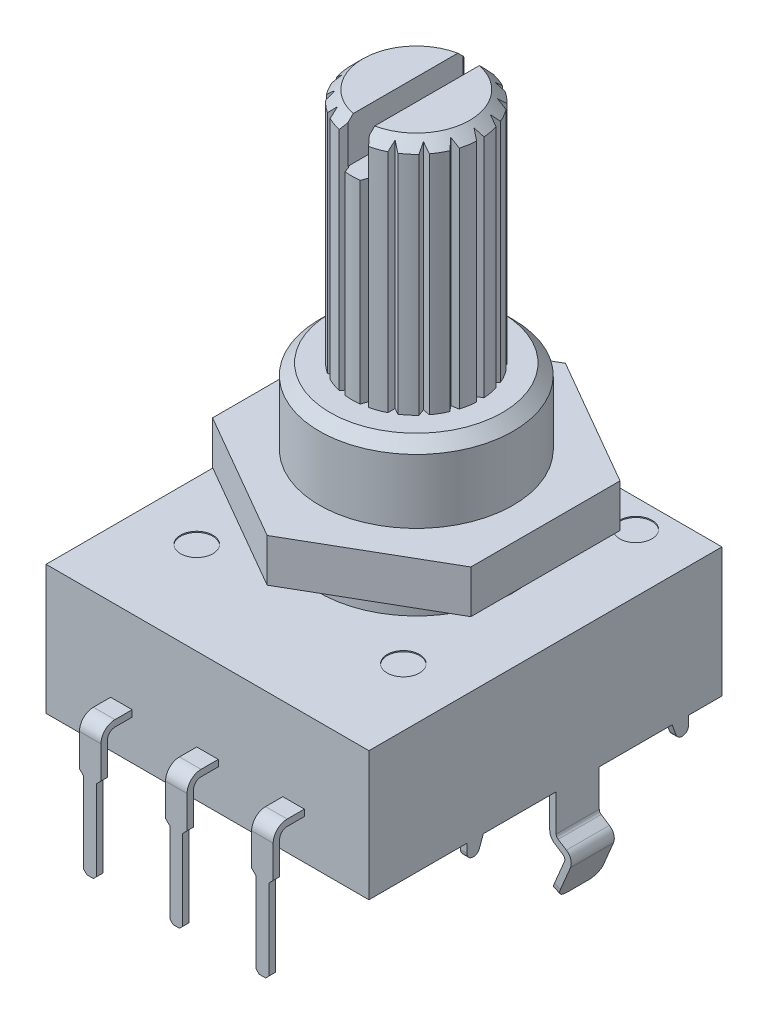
from build123d import *

# Parameters (mm, degrees)
SKETCH1_W                               = 15
SKETCH1_H                               = 16.4
BODY_DEPTH                              = 6
PCB_SPACERS_DEPTH                       = 0.3
RIGHT_PCB_TANG_DEPTH                    = 1
FILLET1_R                               = 0.5
FILLET1_OF_LEFT_PCB_TANG_R              = 0.5
SKETCH4_R                               = 0.75
DIMPLES_DEPTH                           = 0.05
CONTACTS_DEPTH                          = 4.5
CUT_EXTRUDE2_START                      = -1.45
CUT_EXTRUDE2_DEPTH                      = 1.45
CHAMFER1_SIZE                           = 0.15
SCREWDRIVER_SLOT_REACH                  = 24.706
SCREWDRIVER_SLOT_END_RADIUS             = 2.98
SKETCH8_W                               = 1
SKETCH8_H                               = 2
SCREWDRIVER_SLOT_DIRECTION_2_REACH      = 24.706
SCREWDRIVER_SLOT_DIRECTION_2_END_RADIUS = 2.98
SERATION_REACH                          = 24.155
F_18_CERATIONS_COUNT                    = 18
SKETCH10_R                              = 4
NUT_DEPTH                               = 2


with BuildPart() as part:
    # Sketch1 → body (new body)
    with BuildSketch(Plane(origin=(0, 0, 0), x_dir=(1, 0, 0), z_dir=(0, 1, 0))):
        with Locations((0, -1.5)):
            Rectangle(SKETCH1_W, SKETCH1_H)
    extrude(amount=-BODY_DEPTH)

    # Sketch2 → pcb spacers (add)
    with BuildSketch(Plane(origin=(7.5, 0, 0), x_dir=(0, 0, -1), z_dir=(1, 0, 0))):
        with BuildLine():
            Line((-5.15, -6), (-5.15, -6.4))
            ThreePointArc((-5.15, -6.4), (-4.902094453, -6.695442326), (-4.568092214, -6.502606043))
            Line((-4.568092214, -6.502606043), (-4.385158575, -6))
            Line((-4.385158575, -6), (-5.15, -6))
        make_face()
        with BuildLine():
            Line((5.15, -6), (5.15, -6.4))
            ThreePointArc((5.15, -6.4), (4.902094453, -6.695442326), (4.568092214, -6.502606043))
            Line((4.568092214, -6.502606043), (4.385158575, -6))
            Line((4.385158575, -6), (5.15, -6))
        make_face()
    pcb_spacers = extrude(amount=-PCB_SPACERS_DEPTH)

    # Sketch3 → right pcb tang (add, symmetric)
    with BuildSketch(Plane.XY):
        with BuildLine():
            Line((7.5, -6), (7.5, -7.703188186))
            ThreePointArc((7.5, -7.703188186), (7.524378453, -7.798880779), (7.591570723, -7.871244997))
            Line((7.591570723, -7.871244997), (7.971073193, -8.116097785))
            ThreePointArc((7.971073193, -8.116097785), (8.177716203, -8.388634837), (8.160830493, -8.730237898))
            Line((8.160830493, -8.730237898), (7.5, -10.3))
            Line((7.5, -10.3), (7.223501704, -10.183601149))
            Line((7.223501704, -10.183601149), (7.884332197, -8.613839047))
            ThreePointArc((7.884332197, -8.613839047), (7.891086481, -8.477197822), (7.808429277, -8.368183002))
            Line((7.808429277, -8.368183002), (7.428926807, -8.123330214))
            ThreePointArc((7.428926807, -8.123330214), (7.260946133, -7.942419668), (7.2, -7.703188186))
            Line((7.2, -7.703188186), (7.2, -6))
            Line((7.2, -6), (7.5, -6))
        make_face()
    right_pcb_tang = extrude(amount=RIGHT_PCB_TANG_DEPTH, both=True)

    # Fillet1
    fillet1_edges = [part.edges().sort_by_distance(p)[0] for p in [
        (7.361750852, -10.241800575, -1),
        (7.361750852, -10.241800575, 1),
    ]]
    fillet(fillet1_edges, radius=FILLET1_R)

    # left pcb tang: pcb spacers, right pcb tang across plane
    add(pcb_spacers.mirror(Plane(origin=(0, 0, 0), x_dir=(0, 0, 1), z_dir=(1, 0, 0))))
    add(right_pcb_tang.mirror(Plane(origin=(0, 0, 0), x_dir=(0, 0, 1), z_dir=(1, 0, 0))))

    # Fillet1 of left pcb tang
    fillet1_of_left_pcb_tang_edges = [part.edges().sort_by_distance(p)[0] for p in [
        (-7.361750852, -10.241800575, -1),
        (-7.361750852, -10.241800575, 1),
    ]]
    fillet(fillet1_of_left_pcb_tang_edges, radius=FILLET1_OF_LEFT_PCB_TANG_R)

    # Sketch4 → dimples (cut)
    with BuildSketch(Plane(origin=(0, 0, 0), x_dir=(1, 0, 0), z_dir=(0, 1, 0))):
        with Locations(Location((-4.8, 5.4, 0), (0, 0, 270))):
            Circle(SKETCH4_R)
        with Locations(Location((4.8, 5.4, 0), (0, 0, 90))):
            Circle(SKETCH4_R)
        with Locations(Location((4.8, -5.4, 0), (0, 0, 270))):
            Circle(SKETCH4_R)
        with Locations(Location((-4.8, -5.4, 0), (0, 0, 90))):
            Circle(SKETCH4_R)
    extrude(amount=-DIMPLES_DEPTH, mode=Mode.SUBTRACT)

    # Sketch5 → contacts (add, symmetric)
    with BuildSketch(Plane(origin=(0, 0, 0), x_dir=(0, 0, -1), z_dir=(1, 0, 0))):
        with BuildLine():
            Line((-9.7, -3.85), (-10.5, -3.85))
            ThreePointArc((-10.5, -3.85), (-10.959619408, -4.040380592), (-11.15, -4.5))
            Line((-11.15, -4.5), (-11.15, -10.095442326))
            Line((-11.15, -10.095442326), (-10.85, -10.095442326))
            Line((-10.85, -10.095442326), (-10.85, -4.5))
            ThreePointArc((-10.85, -4.5), (-10.747487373, -4.252512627), (-10.5, -4.15))
            Line((-10.5, -4.15), (-9.7, -4.15))
            Line((-9.7, -4.15), (-9.7, -3.85))
        make_face()
    extrude(amount=CONTACTS_DEPTH, both=True)

    # Sketch6 → Cut-Extrude2 (cut)
    with BuildSketch(Plane.XY.offset(11.15).offset(CUT_EXTRUDE2_START)):
        Polygon((-4.5, -6), (-4.3, -6.2), (-4.3, -10.095442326), (-4.5, -10.095442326), align=None)
        Polygon((4.5, -6), (4.3, -6.2), (4.3, -10.095442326), (4.5, -10.095442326), align=None)
        Polygon((-3.7, -10.095442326), (-3.7, -6.2), (-3.5, -6), (-3.5, -3.85), (-0.5, -3.85), (-0.5, -6), (-0.3, -6.2), (-0.3, -10.095442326), align=None)
        Polygon((3.7, -10.095442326), (3.7, -6.2), (3.5, -6), (3.5, -3.85), (0.5, -3.85), (0.5, -6), (0.3, -6.2), (0.3, -10.095442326), align=None)
    extrude(amount=CUT_EXTRUDE2_DEPTH, mode=Mode.SUBTRACT)

    # Chamfer1
    chamfer1_edges = [part.edges().sort_by_distance(p)[0] for p in [
        (-4.3, -10.095442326, 11),
        (4.3, -10.095442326, 11),
        (-0.3, -10.095442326, 11),
        (-3.7, -10.095442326, 11),
        (3.7, -10.095442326, 11),
        (0.3, -10.095442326, 11),
    ]]
    chamfer(chamfer1_edges, length=CHAMFER1_SIZE)

    # Sketch7 → main stem (revolve)
    with BuildSketch(Plane.XY, mode=Mode.PRIVATE) as main_stem_sk:
        Polygon((-4.5, 0), (-4.5, 6.5), (-4, 7), (-2.98, 7), (-2.98, 17.5), (-2.48, 18), (0, 18), (0, 0), align=None)
    revolve(main_stem_sk.sketch.rotate(Axis((0, 0, 0), (0, 1, 0)), 270), axis=Axis((0, 0, 0), (0, 1, 0)))

    # screwdriver slot: up to this cylinder (the profile starts inside it)
    screwdriver_slot_end = Plane(origin=(0, 17, 0), z_dir=(0, -1, 0)) * Cylinder(SCREWDRIVER_SLOT_END_RADIUS, 56.372, mode=Mode.PRIVATE)
    # Sketch8 → screwdriver slot (cut, up to the surface)
    with BuildSketch(Plane.XY, mode=Mode.PRIVATE) as screwdriver_slot_sk1:
        with Locations((0, 17)):
            Rectangle(SKETCH8_W, SKETCH8_H)
    screwdriver_slot_tool1 = extrude(screwdriver_slot_sk1.sketch, amount=-SCREWDRIVER_SLOT_REACH, mode=Mode.PRIVATE) & screwdriver_slot_end
    add(screwdriver_slot_tool1.solids().sort_by_distance((0, 17, 0))[0], mode=Mode.SUBTRACT)

    # screwdriver slot direction 2: up to this cylinder (the profile starts inside it)
    screwdriver_slot_direction_2_end = Plane(origin=(0, 17, 0), z_dir=(0, -1, 0)) * Cylinder(SCREWDRIVER_SLOT_DIRECTION_2_END_RADIUS, 56.372, mode=Mode.PRIVATE)
    # Sketch8 → screwdriver slot direction 2 (cut, up to the surface)
    with BuildSketch(Plane.XY, mode=Mode.PRIVATE) as screwdriver_slot_direction_2_sk1:
        with Locations((0, 17)):
            Rectangle(SKETCH8_W, SKETCH8_H)
    screwdriver_slot_direction_2_tool1 = extrude(screwdriver_slot_direction_2_sk1.sketch, amount=SCREWDRIVER_SLOT_DIRECTION_2_REACH, mode=Mode.PRIVATE) & screwdriver_slot_direction_2_end
    add(screwdriver_slot_direction_2_tool1.solids().sort_by_distance((0, 17, 0))[0], mode=Mode.SUBTRACT)

    # seration: up to this cone (the profile starts inside it)
    seration_end = Plane(origin=(0, 7, 0), z_dir=(0, -1, 0)).offset(-13.479999) * Cone(1e-06, 51.615, 51.614999, align=(Align.CENTER, Align.CENTER, Align.MIN), mode=Mode.PRIVATE)
    # Sketch9 → seration (cut, up to the surface)
    with BuildSketch(Plane(origin=(0, 7, 0), x_dir=(1, 0, 0), z_dir=(0, 1, 0)), mode=Mode.PRIVATE) as seration_sk1:
        with BuildLine():
            Line((2.68, 0), (2.975124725, 0.17039034))
            ThreePointArc((2.975124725, 0.17039034), (2.98, 0), (2.975124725, -0.17039034))
            Line((2.975124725, -0.17039034), (2.68, 0))
        make_face()
    seration_tool1 = extrude(seration_sk1.sketch, amount=SERATION_REACH, mode=Mode.PRIVATE) & seration_end
    seration = seration_tool1.solids().sort_by_distance((2.878912, 7, 0))[0]
    add(seration, mode=Mode.SUBTRACT)

    # 18 cerations: seration ×18 about axis
    f_18_cerations_axis = Axis((0, 0, 0), (0, 1, 0))
    for i in range(1, F_18_CERATIONS_COUNT):
        add(seration.rotate(f_18_cerations_axis, i * 360 / F_18_CERATIONS_COUNT), mode=Mode.SUBTRACT)


with BuildPart() as body_2:
    # Sketch10 → nut (new body)
    with BuildSketch(Plane(origin=(0, 1.524, 0), x_dir=(-1, 0, 0), z_dir=(0, 1, 0))):
        Polygon((0, 6.92820323), (-6, 3.464101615), (-6, -3.464101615), (0, -6.92820323), (6, -3.464101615), (6, 3.464101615), align=None)
        with Locations(Location((0, 0, 0), (0, 0, 90))):
            Circle(SKETCH10_R, mode=Mode.SUBTRACT)
    extrude(amount=NUT_DEPTH)


solid = Compound([part.part, body_2.part])
